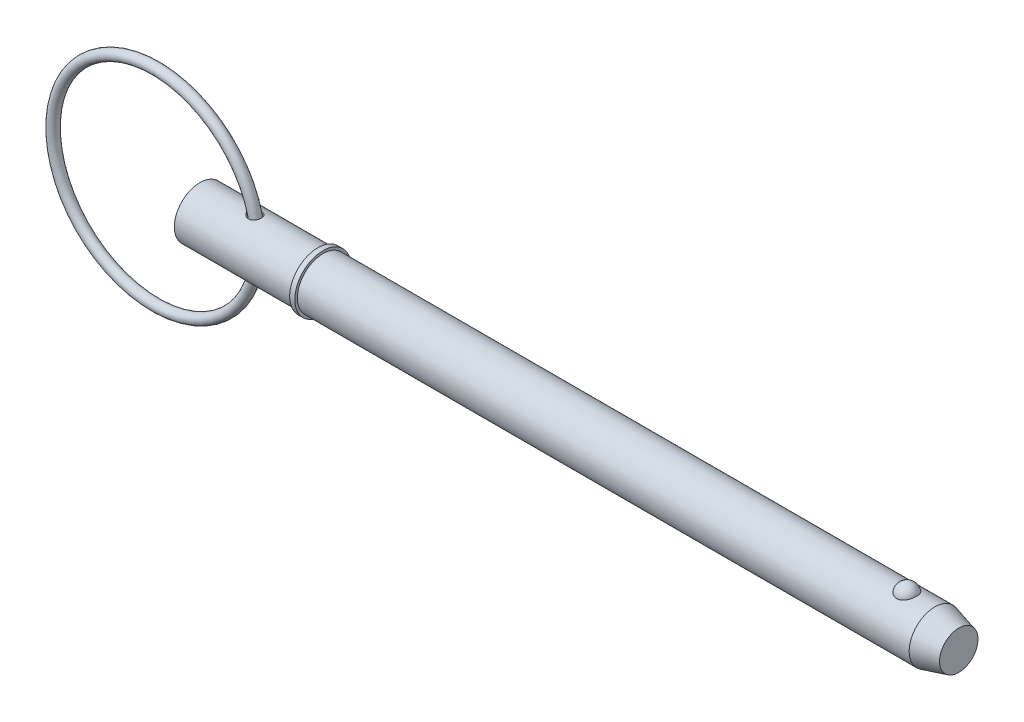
ISO-10303-21;
HEADER;
FILE_DESCRIPTION(('STEP AP214'),'2;1');
FILE_NAME('part.step','',(''),(''),'','','');
FILE_SCHEMA(('AUTOMOTIVE_DESIGN { 1 0 10303 214 1 1 1 1 }'));
ENDSEC;
DATA;
#1=APPLICATION_CONTEXT('core data for automotive mechanical design processes');
#2=APPLICATION_PROTOCOL_DEFINITION('international standard','automotive_design',2000,#1);
#3=PRODUCT_CONTEXT('',#1,'mechanical');
#4=PRODUCT('Part','Part','',(#3));
#5=PRODUCT_RELATED_PRODUCT_CATEGORY('part','',(#4));
#6=PRODUCT_DEFINITION_FORMATION('','',#4);
#7=PRODUCT_DEFINITION_CONTEXT('part definition',#1,'design');
#8=PRODUCT_DEFINITION('design','',#6,#7);
#9=PRODUCT_DEFINITION_SHAPE('','',#8);
#10=(LENGTH_UNIT() NAMED_UNIT(*) SI_UNIT(.MILLI.,.METRE.));
#11=(NAMED_UNIT(*) PLANE_ANGLE_UNIT() SI_UNIT($,.RADIAN.));
#12=(NAMED_UNIT(*) SI_UNIT($,.STERADIAN.) SOLID_ANGLE_UNIT());
#13=UNCERTAINTY_MEASURE_WITH_UNIT(LENGTH_MEASURE(1.E-05),#10,'distance_accuracy_value','');
#14=(GEOMETRIC_REPRESENTATION_CONTEXT(3) GLOBAL_UNCERTAINTY_ASSIGNED_CONTEXT((#13)) GLOBAL_UNIT_ASSIGNED_CONTEXT((#10,
#11,#12)) REPRESENTATION_CONTEXT('',''));
#15=CARTESIAN_POINT('',(0.,0.,0.));
#16=DIRECTION('',(0.,0.,1.));
#17=DIRECTION('',(1.,0.,0.));
#18=AXIS2_PLACEMENT_3D('',#15,#16,#17);
#19=CARTESIAN_POINT('',(-6.86864682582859,0.,0.));
#20=DIRECTION('',(0.,0.,1.));
#21=DIRECTION('',(1.,0.,0.));
#22=AXIS2_PLACEMENT_3D('',#19,#20,#21);
#23=TOROIDAL_SURFACE('',#22,15.875,0.794);
#24=CARTESIAN_POINT('',(9.80035317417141,0.,0.));
#25=VERTEX_POINT('',#24);
#26=VERTEX_LOOP('',#25);
#27=FACE_BOUND('',#26,.T.);
#28=ADVANCED_FACE('P0_F12',(#27),#23,.T.);
#29=CLOSED_SHELL('',(#28));
#30=MANIFOLD_SOLID_BREP('P0_B1',#29);
#31=CARTESIAN_POINT('',(0.,0.,0.));
#32=DIRECTION('',(1.,0.,0.));
#33=DIRECTION('',(0.,0.,-1.));
#34=AXIS2_PLACEMENT_3D('',#31,#32,#33);
#35=CYLINDRICAL_SURFACE('',#34,3.97);
#36=CARTESIAN_POINT('',(7.49679817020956,3.96502331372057,-0.198721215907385));
#37=CARTESIAN_POINT('',(7.50881508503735,3.96235594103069,-0.251916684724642));
#38=CARTESIAN_POINT('',(7.52561550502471,3.95866151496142,-0.304017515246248));
#39=CARTESIAN_POINT('',(7.56786984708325,3.9496659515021,-0.40447153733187));
#40=CARTESIAN_POINT('',(7.59333797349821,3.94436217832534,-0.452818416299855));
#41=CARTESIAN_POINT('',(7.65162192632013,3.93277091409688,-0.544364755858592));
#42=CARTESIAN_POINT('',(7.68440149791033,3.92648832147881,-0.587588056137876));
#43=CARTESIAN_POINT('',(7.75622109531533,3.91354812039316,-0.668369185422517));
#44=CARTESIAN_POINT('',(7.79526077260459,3.90689053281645,-0.705927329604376));
#45=CARTESIAN_POINT('',(7.88192852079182,3.8932854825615,-0.777603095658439));
#46=CARTESIAN_POINT('',(7.92999678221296,3.88635845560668,-0.811192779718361));
#47=CARTESIAN_POINT('',(8.03094744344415,3.87352417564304,-0.870420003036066));
#48=CARTESIAN_POINT('',(8.08383192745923,3.86761736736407,-0.896054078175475));
#49=CARTESIAN_POINT('',(8.19632733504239,3.85719062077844,-0.939958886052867));
#50=CARTESIAN_POINT('',(8.25615064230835,3.85277154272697,-0.957713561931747));
#51=CARTESIAN_POINT('',(8.37807849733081,3.84644428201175,-0.982821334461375));
#52=CARTESIAN_POINT('',(8.44018249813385,3.84453550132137,-0.990176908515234));
#53=CARTESIAN_POINT('',(8.56256649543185,3.84359535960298,-0.993820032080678));
#54=CARTESIAN_POINT('',(8.62283390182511,3.84446524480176,-0.990487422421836));
#55=CARTESIAN_POINT('',(8.74175397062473,3.84884648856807,-0.973323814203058));
#56=CARTESIAN_POINT('',(8.8004073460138,3.85235666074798,-0.959497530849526));
#57=CARTESIAN_POINT('',(8.91034168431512,3.86130428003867,-0.922798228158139));
#58=CARTESIAN_POINT('',(8.96185380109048,3.86659969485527,-0.900580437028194));
#59=CARTESIAN_POINT('',(9.06016940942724,3.87853590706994,-0.847697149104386));
#60=CARTESIAN_POINT('',(9.10697344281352,3.88517654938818,-0.817032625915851));
#61=CARTESIAN_POINT('',(9.19340982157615,3.89885483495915,-0.748999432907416));
#62=CARTESIAN_POINT('',(9.23319345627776,3.90587821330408,-0.711819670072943));
#63=CARTESIAN_POINT('',(9.30598310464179,3.91969783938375,-0.631295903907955));
#64=CARTESIAN_POINT('',(9.33898892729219,3.92649408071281,-0.587951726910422));
#65=CARTESIAN_POINT('',(9.39769437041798,3.939185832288,-0.495874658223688));
#66=CARTESIAN_POINT('',(9.42332322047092,3.94507238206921,-0.447095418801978));
#67=CARTESIAN_POINT('',(9.46625710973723,3.9552342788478,-0.345845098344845));
#68=CARTESIAN_POINT('',(9.48356178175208,3.95950955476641,-0.293373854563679));
#69=CARTESIAN_POINT('',(9.50956700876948,3.96602451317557,-0.185698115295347));
#70=CARTESIAN_POINT('',(9.51818595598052,3.96824487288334,-0.13047272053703));
#71=CARTESIAN_POINT('',(9.52633336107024,3.97034220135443,-0.0193113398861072));
#72=CARTESIAN_POINT('',(9.52586171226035,3.97021914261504,0.0366246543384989));
#73=CARTESIAN_POINT('',(9.51583327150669,3.9676413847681,0.147685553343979));
#74=CARTESIAN_POINT('',(9.50626624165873,3.96518405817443,0.202809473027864));
#75=CARTESIAN_POINT('',(9.47825604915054,3.95819854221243,0.310618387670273));
#76=CARTESIAN_POINT('',(9.45981267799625,3.95367030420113,0.36330332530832));
#77=CARTESIAN_POINT('',(9.41448405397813,3.94303435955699,0.464739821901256));
#78=CARTESIAN_POINT('',(9.38759833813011,3.93692656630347,0.51349116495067));
#79=CARTESIAN_POINT('',(9.32603556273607,3.92380455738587,0.605663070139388));
#80=CARTESIAN_POINT('',(9.29135869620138,3.91679036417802,0.649083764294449));
#81=CARTESIAN_POINT('',(9.21526329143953,3.90267522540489,0.729160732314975));
#82=CARTESIAN_POINT('',(9.17387556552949,3.89557480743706,0.765846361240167));
#83=CARTESIAN_POINT('',(9.08536362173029,3.88206315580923,0.831635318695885));
#84=CARTESIAN_POINT('',(9.03824022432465,3.8756518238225,0.860739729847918));
#85=CARTESIAN_POINT('',(8.94022154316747,3.86431915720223,0.910262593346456));
#86=CARTESIAN_POINT('',(8.88938101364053,3.85938013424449,0.930785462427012));
#87=CARTESIAN_POINT('',(8.78488780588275,3.85141510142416,0.96321476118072));
#88=CARTESIAN_POINT('',(8.73123520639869,3.84838903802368,0.975121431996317));
#89=CARTESIAN_POINT('',(8.62249427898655,3.84453017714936,0.990226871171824));
#90=CARTESIAN_POINT('',(8.56740225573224,3.84370373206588,0.993400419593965));
#91=CARTESIAN_POINT('',(8.45741104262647,3.8442816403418,0.991160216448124));
#92=CARTESIAN_POINT('',(8.40251189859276,3.84568649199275,0.98574454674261));
#93=CARTESIAN_POINT('',(8.29176880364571,3.85062289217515,0.966285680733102));
#94=CARTESIAN_POINT('',(8.23599684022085,3.85424894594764,0.951858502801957));
#95=CARTESIAN_POINT('',(8.12747212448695,3.86325492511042,0.91461785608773));
#96=CARTESIAN_POINT('',(8.0747205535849,3.86863553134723,0.891801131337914));
#97=CARTESIAN_POINT('',(7.97015235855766,3.88095261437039,0.836633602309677));
#98=CARTESIAN_POINT('',(7.91862083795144,3.88796764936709,0.803758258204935));
#99=CARTESIAN_POINT('',(7.82179253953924,3.90250904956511,0.729888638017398));
#100=CARTESIAN_POINT('',(7.77649765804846,3.91003556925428,0.688891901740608));
#101=CARTESIAN_POINT('',(7.69332536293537,3.92478114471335,0.599225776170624));
#102=CARTESIAN_POINT('',(7.6555122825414,3.93199714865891,0.550495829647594));
#103=CARTESIAN_POINT('',(7.5894819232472,3.94512912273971,0.446741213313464));
#104=CARTESIAN_POINT('',(7.56125849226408,3.95104592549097,0.391720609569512));
#105=CARTESIAN_POINT('',(7.51806227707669,3.9603062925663,0.282172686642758));
#106=CARTESIAN_POINT('',(7.50213211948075,3.96383230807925,0.228039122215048));
#107=CARTESIAN_POINT('',(7.48057398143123,3.96863642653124,0.117706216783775));
#108=CARTESIAN_POINT('',(7.47492746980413,3.96991857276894,0.0615107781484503));
#109=CARTESIAN_POINT('',(7.47437932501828,3.97004395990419,-0.0289758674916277));
#110=CARTESIAN_POINT('',(7.47615129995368,3.96964216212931,-0.0632805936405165));
#111=CARTESIAN_POINT('',(7.48358566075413,3.96796978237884,-0.131441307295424));
#112=CARTESIAN_POINT('',(7.48924767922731,3.96669928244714,-0.165297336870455));
#113=CARTESIAN_POINT('',(7.49679817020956,3.96502331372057,-0.198721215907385));
#114=B_SPLINE_CURVE_WITH_KNOTS('',3,(#36,#37,#38,#39,#40,#41,#42,#43,#44,#45,#46,#47,#48,#49,
#50,#51,#52,#53,#54,#55,#56,#57,#58,#59,#60,#61,#62,#63,#64,#65,#66,#67,#68,#69,#70,#71,#72,#73,
#74,#75,#76,#77,#78,#79,#80,#81,#82,#83,#84,#85,#86,#87,#88,#89,#90,#91,#92,#93,#94,#95,#96,#97,
#98,#99,#100,#101,#102,#103,#104,#105,#106,#107,#108,#109,#110,#111,#112,#113),.UNSPECIFIED.,
.T.,.F.,(4,2,2,2,2,2,2,2,2,2,2,2,2,2,2,2,2,2,2,2,2,2,2,2,2,2,2,2,2,2,2,2,2,2,2,2,2,2,4),(0.,
0.163661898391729,0.327593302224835,0.490729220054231,0.653856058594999,0.830244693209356,
1.00671002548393,1.1934572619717,1.38016000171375,1.56030212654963,1.74036335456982,
1.90857505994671,2.07676738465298,2.24071128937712,2.40465981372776,2.57013239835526,
2.73561228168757,2.90263284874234,3.06965537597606,3.23686612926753,3.40408081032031,
3.5713046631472,3.73852437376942,3.90499698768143,4.07144581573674,4.2358058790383,
4.40016134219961,4.56499094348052,4.72985735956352,4.90227873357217,5.0747670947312,
5.25849939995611,5.44228744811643,5.62759301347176,5.81277947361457,5.98144776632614,
6.14981181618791,6.25265388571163,6.35548624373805),.UNSPECIFIED.);
#115=CARTESIAN_POINT('',(7.49679817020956,3.96502331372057,-0.198721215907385));
#116=VERTEX_POINT('',#115);
#117=EDGE_CURVE('P1_E42',#116,#116,#114,.T.);
#118=ORIENTED_EDGE('',*,*,#117,.T.);
#119=EDGE_LOOP('',(#118));
#120=FACE_BOUND('',#119,.T.);
#121=CARTESIAN_POINT('',(0.,0.,0.));
#122=DIRECTION('',(1.,0.,0.));
#123=DIRECTION('',(0.,0.,-1.));
#124=AXIS2_PLACEMENT_3D('',#121,#122,#123);
#125=CIRCLE('',#124,3.97);
#126=CARTESIAN_POINT('',(0.,0.,-3.97));
#127=VERTEX_POINT('',#126);
#128=EDGE_CURVE('P1_E9',#127,#127,#125,.T.);
#129=ORIENTED_EDGE('',*,*,#128,.T.);
#130=EDGE_LOOP('',(#129));
#131=FACE_BOUND('',#130,.T.);
#132=CARTESIAN_POINT('',(18.256,0.,0.));
#133=DIRECTION('',(1.,0.,0.));
#134=DIRECTION('',(0.,0.,-1.));
#135=AXIS2_PLACEMENT_3D('',#132,#133,#134);
#136=CIRCLE('',#135,3.97);
#137=CARTESIAN_POINT('',(18.256,0.,-3.97));
#138=VERTEX_POINT('',#137);
#139=EDGE_CURVE('P1_E25',#138,#138,#136,.T.);
#140=ORIENTED_EDGE('',*,*,#139,.F.);
#141=EDGE_LOOP('',(#140));
#142=FACE_BOUND('',#141,.T.);
#143=CARTESIAN_POINT('',(7.49679817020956,-3.96502331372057,-0.198721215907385));
#144=CARTESIAN_POINT('',(7.48580986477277,-3.96746179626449,-0.150065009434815));
#145=CARTESIAN_POINT('',(7.47881617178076,-3.96904213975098,-0.100459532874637));
#146=CARTESIAN_POINT('',(7.47318383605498,-3.97031279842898,-0.000748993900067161));
#147=CARTESIAN_POINT('',(7.47454464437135,-3.97000323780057,0.049356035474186));
#148=CARTESIAN_POINT('',(7.48554252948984,-3.9675299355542,0.148550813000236));
#149=CARTESIAN_POINT('',(7.49517270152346,-3.9653677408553,0.197641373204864));
#150=CARTESIAN_POINT('',(7.5222068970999,-3.95942609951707,0.293523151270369));
#151=CARTESIAN_POINT('',(7.53961293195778,-3.9556462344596,0.340313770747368));
#152=CARTESIAN_POINT('',(7.58186218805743,-3.946757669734,0.431446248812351));
#153=CARTESIAN_POINT('',(7.6068526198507,-3.94162295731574,0.475716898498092));
#154=CARTESIAN_POINT('',(7.66318857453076,-3.93055115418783,0.559886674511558));
#155=CARTESIAN_POINT('',(7.69453617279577,-3.92461380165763,0.599784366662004));
#156=CARTESIAN_POINT('',(7.76618955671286,-3.91181958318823,0.678467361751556));
#157=CARTESIAN_POINT('',(7.80708710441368,-3.90493119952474,0.716708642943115));
#158=CARTESIAN_POINT('',(7.89431870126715,-3.89148185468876,0.786469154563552));
#159=CARTESIAN_POINT('',(7.94065563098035,-3.88492106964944,0.817984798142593));
#160=CARTESIAN_POINT('',(8.04208221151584,-3.87221514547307,0.876253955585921));
#161=CARTESIAN_POINT('',(8.09758465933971,-3.8661622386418,0.902312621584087));
#162=CARTESIAN_POINT('',(8.21228401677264,-3.855952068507,0.944996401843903));
#163=CARTESIAN_POINT('',(8.27148128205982,-3.85179498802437,0.961620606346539));
#164=CARTESIAN_POINT('',(8.39228716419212,-3.84593851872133,0.984786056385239));
#165=CARTESIAN_POINT('',(8.45390693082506,-3.84425231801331,0.991273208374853));
#166=CARTESIAN_POINT('',(8.57734686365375,-3.84370168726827,0.993408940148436));
#167=CARTESIAN_POINT('',(8.63916691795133,-3.84483588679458,0.989062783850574));
#168=CARTESIAN_POINT('',(8.75703619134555,-3.84970227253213,0.969937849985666));
#169=CARTESIAN_POINT('',(8.81320274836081,-3.85326512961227,0.955838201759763));
#170=CARTESIAN_POINT('',(8.92207486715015,-3.8624204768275,0.918140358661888));
#171=CARTESIAN_POINT('',(8.97478130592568,-3.86801245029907,0.89454458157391));
#172=CARTESIAN_POINT('',(9.07264210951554,-3.88024902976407,0.83982747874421));
#173=CARTESIAN_POINT('',(9.11803751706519,-3.88683023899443,0.809121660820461));
#174=CARTESIAN_POINT('',(9.20292513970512,-3.90048324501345,0.740506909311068));
#175=CARTESIAN_POINT('',(9.24241747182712,-3.90755503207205,0.702598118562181));
#176=CARTESIAN_POINT('',(9.31440361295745,-3.92139192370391,0.620727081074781));
#177=CARTESIAN_POINT('',(9.34691105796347,-3.9281576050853,0.576776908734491));
#178=CARTESIAN_POINT('',(9.40424150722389,-3.94066521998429,0.483990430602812));
#179=CARTESIAN_POINT('',(9.4290641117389,-3.94640710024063,0.435153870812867));
#180=CARTESIAN_POINT('',(9.47070060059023,-3.95631713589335,0.333318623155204));
#181=CARTESIAN_POINT('',(9.48741220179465,-3.96046506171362,0.280276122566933));
#182=CARTESIAN_POINT('',(9.51197570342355,-3.9666399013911,0.172058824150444));
#183=CARTESIAN_POINT('',(9.5198274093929,-3.96866676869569,0.116883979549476));
#184=CARTESIAN_POINT('',(9.52650209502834,-3.9703865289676,0.00572427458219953));
#185=CARTESIAN_POINT('',(9.52528754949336,-3.97006972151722,-0.0502629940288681));
#186=CARTESIAN_POINT('',(9.51376883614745,-3.96711300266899,-0.161232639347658));
#187=CARTESIAN_POINT('',(9.50346452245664,-3.96447305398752,-0.216214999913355));
#188=CARTESIAN_POINT('',(9.47400716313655,-3.95715440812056,-0.323616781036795));
#189=CARTESIAN_POINT('',(9.45485370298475,-3.95247561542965,-0.376036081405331));
#190=CARTESIAN_POINT('',(9.40815019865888,-3.94158766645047,-0.47682082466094));
#191=CARTESIAN_POINT('',(9.38060003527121,-3.93537848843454,-0.525186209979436));
#192=CARTESIAN_POINT('',(9.31780916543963,-3.92212278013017,-0.616423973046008));
#193=CARTESIAN_POINT('',(9.28257772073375,-3.91507726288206,-0.659302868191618));
#194=CARTESIAN_POINT('',(9.20530256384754,-3.90093459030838,-0.738394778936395));
#195=CARTESIAN_POINT('',(9.16325952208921,-3.8938374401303,-0.774608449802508));
#196=CARTESIAN_POINT('',(9.07394283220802,-3.88046830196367,-0.83901178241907));
#197=CARTESIAN_POINT('',(9.02672460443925,-3.87418889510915,-0.867276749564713));
#198=CARTESIAN_POINT('',(8.92806876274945,-3.86308015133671,-0.915492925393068));
#199=CARTESIAN_POINT('',(8.87663164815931,-3.85825064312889,-0.935445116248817));
#200=CARTESIAN_POINT('',(8.77150354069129,-3.85059630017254,-0.966469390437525));
#201=CARTESIAN_POINT('',(8.71783614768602,-3.84775433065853,-0.977617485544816));
#202=CARTESIAN_POINT('',(8.60934883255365,-3.84426767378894,-0.991239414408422));
#203=CARTESIAN_POINT('',(8.55452877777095,-3.84362324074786,-0.993712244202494));
#204=CARTESIAN_POINT('',(8.4438244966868,-3.84454392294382,-0.990144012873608));
#205=CARTESIAN_POINT('',(8.3879479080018,-3.84616465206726,-0.983888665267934));
#206=CARTESIAN_POINT('',(8.27791058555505,-3.85146784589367,-0.962917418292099));
#207=CARTESIAN_POINT('',(8.22375037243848,-3.85515092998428,-0.948198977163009));
#208=CARTESIAN_POINT('',(8.11503410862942,-3.86443542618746,-0.90964598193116));
#209=CARTESIAN_POINT('',(8.06067129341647,-3.87014379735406,-0.885291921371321));
#210=CARTESIAN_POINT('',(7.95661263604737,-3.88274545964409,-0.828274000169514));
#211=CARTESIAN_POINT('',(7.90691941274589,-3.88963940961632,-0.795605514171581));
#212=CARTESIAN_POINT('',(7.81143608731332,-3.90417480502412,-0.720990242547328));
#213=CARTESIAN_POINT('',(7.76592225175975,-3.9118359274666,-0.678692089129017));
#214=CARTESIAN_POINT('',(7.68309200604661,-3.926691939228,-0.586646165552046));
#215=CARTESIAN_POINT('',(7.6457689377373,-3.93388720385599,-0.536904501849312));
#216=CARTESIAN_POINT('',(7.58649683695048,-3.94577687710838,-0.440118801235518));
#217=CARTESIAN_POINT('',(7.56301593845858,-3.95068841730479,-0.394037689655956));
#218=CARTESIAN_POINT('',(7.52386335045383,-3.95904753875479,-0.298549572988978));
#219=CARTESIAN_POINT('',(7.5081856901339,-3.96249623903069,-0.249145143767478));
#220=CARTESIAN_POINT('',(7.49679817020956,-3.96502331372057,-0.198721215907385));
#221=B_SPLINE_CURVE_WITH_KNOTS('',3,(#143,#144,#145,#146,#147,#148,#149,#150,#151,#152,#153,
#154,#155,#156,#157,#158,#159,#160,#161,#162,#163,#164,#165,#166,#167,#168,#169,#170,#171,#172,
#173,#174,#175,#176,#177,#178,#179,#180,#181,#182,#183,#184,#185,#186,#187,#188,#189,#190,#191,
#192,#193,#194,#195,#196,#197,#198,#199,#200,#201,#202,#203,#204,#205,#206,#207,#208,#209,#210,
#211,#212,#213,#214,#215,#216,#217,#218,#219,#220),.UNSPECIFIED.,.T.,.F.,(4,2,2,2,2,2,2,2,2,2,2,
2,2,2,2,2,2,2,2,2,2,2,2,2,2,2,2,2,2,2,2,2,2,2,2,2,2,2,4),(0.,0.149644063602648,
0.299278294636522,0.448787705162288,0.598335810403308,0.750995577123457,0.903705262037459,
1.07224475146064,1.2408739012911,1.4248565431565,1.60885692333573,1.79383585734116,
1.97872492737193,2.15188813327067,2.32500727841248,2.489818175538,2.65462580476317,
2.81910871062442,2.98360017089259,3.15011526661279,3.31663401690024,3.48384236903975,
3.65105340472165,3.81827227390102,3.98549351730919,4.15251423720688,4.31951852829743,
4.48488279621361,4.65022752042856,4.81412860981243,4.97804866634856,5.14606470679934,
5.31413123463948,5.49286956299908,5.67170754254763,5.85859317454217,6.0453263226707,
6.20052601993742,6.35560677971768),.UNSPECIFIED.);
#222=CARTESIAN_POINT('',(7.49679817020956,-3.96502331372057,-0.198721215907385));
#223=VERTEX_POINT('',#222);
#224=EDGE_CURVE('P1_E17',#223,#223,#221,.T.);
#225=ORIENTED_EDGE('',*,*,#224,.T.);
#226=EDGE_LOOP('',(#225));
#227=FACE_BOUND('',#226,.T.);
#228=ADVANCED_FACE('P1_F13',(#120,#131,#142,#227),#35,.T.);
#229=CARTESIAN_POINT('',(0.,0.,0.));
#230=DIRECTION('',(1.,0.,0.));
#231=DIRECTION('',(0.,0.,-1.));
#232=AXIS2_PLACEMENT_3D('',#229,#230,#231);
#233=CYLINDRICAL_SURFACE('',#232,3.97);
#234=CARTESIAN_POINT('',(113.775939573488,0.,0.));
#235=DIRECTION('',(1.,0.,0.));
#236=DIRECTION('',(0.,0.,-1.));
#237=AXIS2_PLACEMENT_3D('',#234,#235,#236);
#238=CIRCLE('',#237,3.97);
#239=CARTESIAN_POINT('',(113.775939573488,0.,-3.97));
#240=VERTEX_POINT('',#239);
#241=EDGE_CURVE('P1_E99',#240,#240,#238,.T.);
#242=ORIENTED_EDGE('',*,*,#241,.F.);
#243=EDGE_LOOP('',(#242));
#244=FACE_BOUND('',#243,.T.);
#245=CARTESIAN_POINT('',(19.05,0.,0.));
#246=DIRECTION('',(1.,0.,0.));
#247=DIRECTION('',(0.,0.,-1.));
#248=AXIS2_PLACEMENT_3D('',#245,#246,#247);
#249=CIRCLE('',#248,3.97);
#250=CARTESIAN_POINT('',(19.05,0.,-3.97));
#251=VERTEX_POINT('',#250);
#252=EDGE_CURVE('P1_E96',#251,#251,#249,.T.);
#253=ORIENTED_EDGE('',*,*,#252,.T.);
#254=EDGE_LOOP('',(#253));
#255=FACE_BOUND('',#254,.T.);
#256=CARTESIAN_POINT('',(109.445192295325,3.65715365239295,1.5447094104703));
#257=CARTESIAN_POINT('',(109.365244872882,3.65716001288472,1.54470290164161));
#258=CARTESIAN_POINT('',(109.285165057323,3.65987074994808,1.53832549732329));
#259=CARTESIAN_POINT('',(109.127237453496,3.6704221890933,1.51297018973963));
#260=CARTESIAN_POINT('',(109.04939614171,3.67827646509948,1.49395894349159));
#261=CARTESIAN_POINT('',(108.898461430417,3.69818848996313,1.44395950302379));
#262=CARTESIAN_POINT('',(108.825356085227,3.71023513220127,1.41300293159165));
#263=CARTESIAN_POINT('',(108.685563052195,3.7372183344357,1.34000212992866));
#264=CARTESIAN_POINT('',(108.618872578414,3.75215363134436,1.29796274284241));
#265=CARTESIAN_POINT('',(108.49148864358,3.78384968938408,1.20248834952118));
#266=CARTESIAN_POINT('',(108.431029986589,3.80065129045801,1.14875388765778));
#267=CARTESIAN_POINT('',(108.319694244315,3.83398532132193,1.03205417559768));
#268=CARTESIAN_POINT('',(108.268820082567,3.85051766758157,0.969086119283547));
#269=CARTESIAN_POINT('',(108.175632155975,3.88238608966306,0.832526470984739));
#270=CARTESIAN_POINT('',(108.133796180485,3.89763698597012,0.758588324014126));
#271=CARTESIAN_POINT('',(108.06251087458,3.92451063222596,0.604352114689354));
#272=CARTESIAN_POINT('',(108.033062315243,3.93613315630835,0.524053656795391));
#273=CARTESIAN_POINT('',(107.986892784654,3.95467606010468,0.358403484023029));
#274=CARTESIAN_POINT('',(107.970312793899,3.96154426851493,0.273006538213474));
#275=CARTESIAN_POINT('',(107.950756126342,3.96967008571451,0.10040860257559));
#276=CARTESIAN_POINT('',(107.947778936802,3.97092790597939,0.0132076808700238));
#277=CARTESIAN_POINT('',(107.955458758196,3.96771794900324,-0.159844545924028));
#278=CARTESIAN_POINT('',(107.966016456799,3.96329187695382,-0.245701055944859));
#279=CARTESIAN_POINT('',(108.00038009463,3.94923163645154,-0.414277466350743));
#280=CARTESIAN_POINT('',(108.024186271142,3.93959737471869,-0.496997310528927));
#281=CARTESIAN_POINT('',(108.08461142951,3.91607752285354,-0.657113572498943));
#282=CARTESIAN_POINT('',(108.121249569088,3.90218558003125,-0.734501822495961));
#283=CARTESIAN_POINT('',(108.206593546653,3.87158287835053,-0.881704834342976));
#284=CARTESIAN_POINT('',(108.255300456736,3.8548718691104,-0.951518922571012));
#285=CARTESIAN_POINT('',(108.364116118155,3.82028735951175,-1.08208159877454));
#286=CARTESIAN_POINT('',(108.424295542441,3.80240713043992,-1.14276958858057));
#287=CARTESIAN_POINT('',(108.554493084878,3.76758161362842,-1.2528243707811));
#288=CARTESIAN_POINT('',(108.624510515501,3.75063626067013,-1.30219195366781));
#289=CARTESIAN_POINT('',(108.77118160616,3.71998948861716,-1.38729709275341));
#290=CARTESIAN_POINT('',(108.847681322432,3.70623183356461,-1.42327904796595));
#291=CARTESIAN_POINT('',(109.006298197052,3.68323188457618,-1.48178996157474));
#292=CARTESIAN_POINT('',(109.0884132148,3.67398788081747,-1.50432401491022));
#293=CARTESIAN_POINT('',(109.251481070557,3.6615216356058,-1.53440939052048));
#294=CARTESIAN_POINT('',(109.332284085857,3.65801951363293,-1.54265826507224));
#295=CARTESIAN_POINT('',(109.49420850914,3.65657341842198,-1.54608423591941));
#296=CARTESIAN_POINT('',(109.575329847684,3.65862829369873,-1.5412640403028));
#297=CARTESIAN_POINT('',(109.732812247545,3.66788969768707,-1.51908474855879));
#298=CARTESIAN_POINT('',(109.809242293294,3.67492621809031,-1.50213925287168));
#299=CARTESIAN_POINT('',(109.958041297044,3.69318404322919,-1.4566698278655));
#300=CARTESIAN_POINT('',(110.030409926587,3.7044056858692,-1.42814496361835));
#301=CARTESIAN_POINT('',(110.170802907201,3.73012749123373,-1.35956319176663));
#302=CARTESIAN_POINT('',(110.238700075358,3.74469307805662,-1.31927107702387));
#303=CARTESIAN_POINT('',(110.366864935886,3.77545272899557,-1.22847440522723));
#304=CARTESIAN_POINT('',(110.427130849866,3.79164717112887,-1.17796747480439));
#305=CARTESIAN_POINT('',(110.541634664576,3.82490325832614,-1.0651926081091));
#306=CARTESIAN_POINT('',(110.595413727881,3.84196735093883,-1.0024591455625));
#307=CARTESIAN_POINT('',(110.692098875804,3.87439863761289,-0.86871586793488));
#308=CARTESIAN_POINT('',(110.735003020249,3.88976552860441,-0.797704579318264));
#309=CARTESIAN_POINT('',(110.810266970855,3.91771381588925,-0.646896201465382));
#310=CARTESIAN_POINT('',(110.84225322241,3.93019255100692,-0.566893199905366));
#311=CARTESIAN_POINT('',(110.893110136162,3.95043886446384,-0.402255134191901));
#312=CARTESIAN_POINT('',(110.911980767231,3.95820643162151,-0.317620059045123));
#313=CARTESIAN_POINT('',(110.93621625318,3.96823733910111,-0.146156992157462));
#314=CARTESIAN_POINT('',(110.941587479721,3.97050327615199,-0.0593300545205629));
#315=CARTESIAN_POINT('',(110.938730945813,3.96930811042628,0.114057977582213));
#316=CARTESIAN_POINT('',(110.930503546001,3.9658471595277,0.200619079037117));
#317=CARTESIAN_POINT('',(110.900706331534,3.95358562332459,0.370506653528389));
#318=CARTESIAN_POINT('',(110.87921294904,3.94481563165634,0.453848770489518));
#319=CARTESIAN_POINT('',(110.82338397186,3.92284586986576,0.615497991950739));
#320=CARTESIAN_POINT('',(110.789047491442,3.90964579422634,0.693804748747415));
#321=CARTESIAN_POINT('',(110.707970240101,3.88006987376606,0.843703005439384));
#322=CARTESIAN_POINT('',(110.661153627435,3.86367478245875,0.915249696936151));
#323=CARTESIAN_POINT('',(110.556189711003,3.82949741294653,1.04910810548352));
#324=CARTESIAN_POINT('',(110.498042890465,3.81171519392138,1.1114202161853));
#325=CARTESIAN_POINT('',(110.371743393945,3.77673366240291,1.22503948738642));
#326=CARTESIAN_POINT('',(110.303597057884,3.75953398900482,1.27635357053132));
#327=CARTESIAN_POINT('',(110.158900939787,3.72770506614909,1.36653336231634));
#328=CARTESIAN_POINT('',(110.082348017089,3.7130767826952,1.40539439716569));
#329=CARTESIAN_POINT('',(109.925759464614,3.68864287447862,1.46830480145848));
#330=CARTESIAN_POINT('',(109.845930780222,3.67869017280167,1.49281289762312));
#331=CARTESIAN_POINT('',(109.682987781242,3.66414535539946,1.52817474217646));
#332=CARTESIAN_POINT('',(109.599884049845,3.65953723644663,1.53906926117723));
#333=CARTESIAN_POINT('',(109.492776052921,3.6573894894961,1.54414878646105));
#334=CARTESIAN_POINT('',(109.468990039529,3.65715175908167,1.54471134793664));
#335=CARTESIAN_POINT('',(109.445192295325,3.65715365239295,1.5447094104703));
#336=B_SPLINE_CURVE_WITH_KNOTS('',3,(#256,#257,#258,#259,#260,#261,#262,#263,#264,#265,#266,
#267,#268,#269,#270,#271,#272,#273,#274,#275,#276,#277,#278,#279,#280,#281,#282,#283,#284,#285,
#286,#287,#288,#289,#290,#291,#292,#293,#294,#295,#296,#297,#298,#299,#300,#301,#302,#303,#304,
#305,#306,#307,#308,#309,#310,#311,#312,#313,#314,#315,#316,#317,#318,#319,#320,#321,#322,#323,
#324,#325,#326,#327,#328,#329,#330,#331,#332,#333,#334,#335),.UNSPECIFIED.,.T.,.F.,(4,2,2,2,2,2,
2,2,2,2,2,2,2,2,2,2,2,2,2,2,2,2,2,2,2,2,2,2,2,2,2,2,2,2,2,2,2,2,2,4),(0.,0.239777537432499,
0.480190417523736,0.719971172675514,0.959647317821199,1.20639040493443,1.45320863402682,
1.71093679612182,1.9686809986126,2.22921052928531,2.48973023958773,2.74834928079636,
3.00697295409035,3.26598440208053,3.52501886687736,3.78570385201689,4.04637062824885,
4.30201257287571,4.55755760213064,4.80022994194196,5.04285200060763,5.27757006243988,
5.51230707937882,5.75210128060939,5.99195126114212,6.2439281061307,6.49594987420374,
6.75588818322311,7.01582710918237,7.27564332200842,7.53545264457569,7.79377886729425,
8.05212290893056,8.31207418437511,8.57201437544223,8.83179046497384,9.09166393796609,
9.34270057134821,9.59298357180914,9.66435753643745),.UNSPECIFIED.);
#337=CARTESIAN_POINT('',(109.445192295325,3.65715365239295,1.5447094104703));
#338=VERTEX_POINT('',#337);
#339=EDGE_CURVE('P1_E34',#338,#338,#336,.T.);
#340=ORIENTED_EDGE('',*,*,#339,.T.);
#341=EDGE_LOOP('',(#340));
#342=FACE_BOUND('',#341,.T.);
#343=ADVANCED_FACE('P1_F46',(#244,#255,#342),#233,.T.);
#344=CARTESIAN_POINT('',(0.,0.,0.));
#345=DIRECTION('',(-1.,0.,0.));
#346=DIRECTION('',(0.,0.,1.));
#347=AXIS2_PLACEMENT_3D('',#344,#345,#346);
#348=PLANE('',#347);
#349=ORIENTED_EDGE('',*,*,#128,.F.);
#350=EDGE_LOOP('',(#349));
#351=FACE_BOUND('',#350,.T.);
#352=ADVANCED_FACE('P1_F15',(#351),#348,.T.);
#353=CARTESIAN_POINT('',(18.256,3.97,0.));
#354=DIRECTION('',(-1.,0.,0.));
#355=DIRECTION('',(0.,0.,1.));
#356=AXIS2_PLACEMENT_3D('',#353,#354,#355);
#357=PLANE('',#356);
#358=ORIENTED_EDGE('',*,*,#139,.T.);
#359=EDGE_LOOP('',(#358));
#360=FACE_BOUND('',#359,.T.);
#361=CARTESIAN_POINT('',(18.256,0.,0.));
#362=DIRECTION('',(1.,0.,0.));
#363=DIRECTION('',(0.,0.,-1.));
#364=AXIS2_PLACEMENT_3D('',#361,#362,#363);
#365=CIRCLE('',#364,4.367);
#366=CARTESIAN_POINT('',(18.256,0.,-4.367));
#367=VERTEX_POINT('',#366);
#368=EDGE_CURVE('P1_E30',#367,#367,#365,.T.);
#369=ORIENTED_EDGE('',*,*,#368,.F.);
#370=EDGE_LOOP('',(#369));
#371=FACE_BOUND('',#370,.T.);
#372=ADVANCED_FACE('P1_F81',(#360,#371),#357,.T.);
#373=CARTESIAN_POINT('',(0.,0.,0.));
#374=DIRECTION('',(1.,0.,0.));
#375=DIRECTION('',(0.,0.,-1.));
#376=AXIS2_PLACEMENT_3D('',#373,#374,#375);
#377=CYLINDRICAL_SURFACE('',#376,4.367);
#378=ORIENTED_EDGE('',*,*,#368,.T.);
#379=EDGE_LOOP('',(#378));
#380=FACE_BOUND('',#379,.T.);
#381=CARTESIAN_POINT('',(19.05,0.,0.));
#382=DIRECTION('',(1.,0.,0.));
#383=DIRECTION('',(0.,0.,-1.));
#384=AXIS2_PLACEMENT_3D('',#381,#382,#383);
#385=CIRCLE('',#384,4.367);
#386=CARTESIAN_POINT('',(19.05,0.,-4.367));
#387=VERTEX_POINT('',#386);
#388=EDGE_CURVE('P1_E95',#387,#387,#385,.T.);
#389=ORIENTED_EDGE('',*,*,#388,.F.);
#390=EDGE_LOOP('',(#389));
#391=FACE_BOUND('',#390,.T.);
#392=ADVANCED_FACE('P1_F68',(#380,#391),#377,.T.);
#393=CARTESIAN_POINT('',(19.05,4.367,0.));
#394=DIRECTION('',(1.,0.,0.));
#395=DIRECTION('',(0.,0.,-1.));
#396=AXIS2_PLACEMENT_3D('',#393,#394,#395);
#397=PLANE('',#396);
#398=ORIENTED_EDGE('',*,*,#388,.T.);
#399=EDGE_LOOP('',(#398));
#400=FACE_BOUND('',#399,.T.);
#401=ORIENTED_EDGE('',*,*,#252,.F.);
#402=EDGE_LOOP('',(#401));
#403=FACE_BOUND('',#402,.T.);
#404=ADVANCED_FACE('P1_F62',(#400,#403),#397,.T.);
#405=CARTESIAN_POINT('',(117.48,0.,0.));
#406=DIRECTION('',(-1.,0.,0.));
#407=DIRECTION('',(0.,0.,1.));
#408=AXIS2_PLACEMENT_3D('',#405,#406,#407);
#409=CONICAL_SURFACE('',#408,2.97750000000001,0.261799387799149);
#410=ORIENTED_EDGE('',*,*,#241,.T.);
#411=EDGE_LOOP('',(#410));
#412=FACE_BOUND('',#411,.T.);
#413=CARTESIAN_POINT('',(117.48,0.,0.));
#414=DIRECTION('',(1.,0.,0.));
#415=DIRECTION('',(0.,0.,-1.));
#416=AXIS2_PLACEMENT_3D('',#413,#414,#415);
#417=CIRCLE('',#416,2.97750000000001);
#418=CARTESIAN_POINT('',(117.48,0.,-2.97750000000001));
#419=VERTEX_POINT('',#418);
#420=EDGE_CURVE('P1_E41',#419,#419,#417,.T.);
#421=ORIENTED_EDGE('',*,*,#420,.F.);
#422=EDGE_LOOP('',(#421));
#423=FACE_BOUND('',#422,.T.);
#424=ADVANCED_FACE('P1_F59',(#412,#423),#409,.T.);
#425=CARTESIAN_POINT('',(117.48,2.97750000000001,0.));
#426=DIRECTION('',(1.,0.,0.));
#427=DIRECTION('',(0.,0.,-1.));
#428=AXIS2_PLACEMENT_3D('',#425,#426,#427);
#429=PLANE('',#428);
#430=ORIENTED_EDGE('',*,*,#420,.T.);
#431=EDGE_LOOP('',(#430));
#432=FACE_BOUND('',#431,.T.);
#433=ADVANCED_FACE('P1_F55',(#432),#429,.T.);
#434=CARTESIAN_POINT('',(109.445192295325,3.57299999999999,0.));
#435=DIRECTION('',(-1.,0.,0.));
#436=DIRECTION('',(0.,1.,0.));
#437=AXIS2_PLACEMENT_3D('',#434,#435,#436);
#438=SPHERICAL_SURFACE('',#437,1.54700000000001);
#439=ORIENTED_EDGE('',*,*,#339,.F.);
#440=EDGE_LOOP('',(#439));
#441=FACE_BOUND('',#440,.T.);
#442=ADVANCED_FACE('P1_F50',(#441),#438,.T.);
#443=CARTESIAN_POINT('',(-6.86864682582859,0.,0.));
#444=DIRECTION('',(0.,0.,1.));
#445=DIRECTION('',(1.,0.,0.));
#446=AXIS2_PLACEMENT_3D('',#443,#444,#445);
#447=TOROIDAL_SURFACE('',#446,15.875,0.992500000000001);
#448=ORIENTED_EDGE('',*,*,#224,.F.);
#449=EDGE_LOOP('',(#448));
#450=FACE_BOUND('',#449,.T.);
#451=ORIENTED_EDGE('',*,*,#117,.F.);
#452=EDGE_LOOP('',(#451));
#453=FACE_BOUND('',#452,.T.);
#454=ADVANCED_FACE('P1_F54',(#450,#453),#447,.F.);
#455=CLOSED_SHELL('',(#228,#343,#352,#372,#392,#404,#424,#433,#442,#454));
#456=MANIFOLD_SOLID_BREP('P1_B1',#455);
#457=ADVANCED_BREP_SHAPE_REPRESENTATION('',(#18,#30,#456),#14);
#458=SHAPE_DEFINITION_REPRESENTATION(#9,#457);
ENDSEC;
END-ISO-10303-21;
